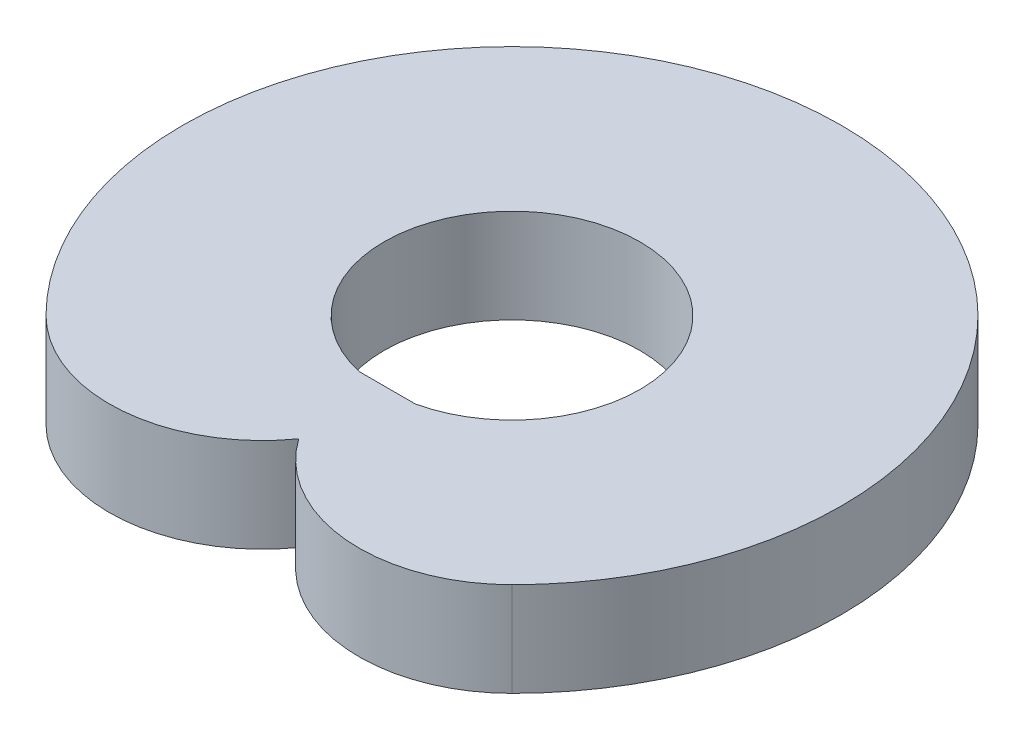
ISO-10303-21;
HEADER;
FILE_DESCRIPTION(('STEP AP214'),'2;1');
FILE_NAME('part.step','',(''),(''),'','','');
FILE_SCHEMA(('AUTOMOTIVE_DESIGN { 1 0 10303 214 1 1 1 1 }'));
ENDSEC;
DATA;
#1=APPLICATION_CONTEXT('core data for automotive mechanical design processes');
#2=APPLICATION_PROTOCOL_DEFINITION('international standard','automotive_design',2000,#1);
#3=PRODUCT_CONTEXT('',#1,'mechanical');
#4=PRODUCT('Part','Part','',(#3));
#5=PRODUCT_RELATED_PRODUCT_CATEGORY('part','',(#4));
#6=PRODUCT_DEFINITION_FORMATION('','',#4);
#7=PRODUCT_DEFINITION_CONTEXT('part definition',#1,'design');
#8=PRODUCT_DEFINITION('design','',#6,#7);
#9=PRODUCT_DEFINITION_SHAPE('','',#8);
#10=(LENGTH_UNIT() NAMED_UNIT(*) SI_UNIT(.MILLI.,.METRE.));
#11=(NAMED_UNIT(*) PLANE_ANGLE_UNIT() SI_UNIT($,.RADIAN.));
#12=(NAMED_UNIT(*) SI_UNIT($,.STERADIAN.) SOLID_ANGLE_UNIT());
#13=UNCERTAINTY_MEASURE_WITH_UNIT(LENGTH_MEASURE(1.E-05),#10,'distance_accuracy_value','');
#14=(GEOMETRIC_REPRESENTATION_CONTEXT(3) GLOBAL_UNCERTAINTY_ASSIGNED_CONTEXT((#13)) GLOBAL_UNIT_ASSIGNED_CONTEXT((#10,
#11,#12)) REPRESENTATION_CONTEXT('',''));
#15=CARTESIAN_POINT('',(0.,0.,0.));
#16=DIRECTION('',(0.,0.,1.));
#17=DIRECTION('',(1.,0.,0.));
#18=AXIS2_PLACEMENT_3D('',#15,#16,#17);
#19=CARTESIAN_POINT('',(132.582521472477,200.,132.582521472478));
#20=DIRECTION('',(0.,1.,0.));
#21=DIRECTION('',(0.,0.,1.));
#22=AXIS2_PLACEMENT_3D('',#19,#20,#21);
#23=PLANE('',#22);
#24=CARTESIAN_POINT('',(265.165042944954,200.,265.165042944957));
#25=DIRECTION('',(0.,1.,0.));
#26=DIRECTION('',(0.,0.,1.));
#27=AXIS2_PLACEMENT_3D('',#24,#25,#26);
#28=CIRCLE('',#27,325.);
#29=CARTESIAN_POINT('',(1.11022302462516E-13,200.,453.08124767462));
#30=VERTEX_POINT('',#29);
#31=CARTESIAN_POINT('',(494.974746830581,200.,494.974746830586));
#32=VERTEX_POINT('',#31);
#33=EDGE_CURVE('E98',#30,#32,#28,.T.);
#34=ORIENTED_EDGE('',*,*,#33,.T.);
#35=CARTESIAN_POINT('',(0.,200.,0.));
#36=DIRECTION('',(0.,1.,0.));
#37=DIRECTION('',(0.,0.,1.));
#38=AXIS2_PLACEMENT_3D('',#35,#36,#37);
#39=CIRCLE('',#38,700.);
#40=CARTESIAN_POINT('',(-494.97474683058,200.,494.974746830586));
#41=VERTEX_POINT('',#40);
#42=EDGE_CURVE('E101',#32,#41,#39,.T.);
#43=ORIENTED_EDGE('',*,*,#42,.T.);
#44=CARTESIAN_POINT('',(-265.165042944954,200.,265.165042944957));
#45=DIRECTION('',(0.,1.,0.));
#46=DIRECTION('',(0.,0.,1.));
#47=AXIS2_PLACEMENT_3D('',#44,#45,#46);
#48=CIRCLE('',#47,325.);
#49=EDGE_CURVE('E104',#41,#30,#48,.T.);
#50=ORIENTED_EDGE('',*,*,#49,.T.);
#51=EDGE_LOOP('',(#34,#43,#50));
#52=FACE_BOUND('',#51,.T.);
#53=DIRECTION('',(1.,0.,0.));
#54=VECTOR('',#53,1.);
#55=CARTESIAN_POINT('',(59.8349570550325,200.,265.165042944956));
#56=LINE('',#55,#54);
#57=CARTESIAN_POINT('',(-59.8349570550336,200.,265.165042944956));
#58=VERTEX_POINT('',#57);
#59=CARTESIAN_POINT('',(59.8349570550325,200.,265.165042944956));
#60=VERTEX_POINT('',#59);
#61=EDGE_CURVE('E81',#58,#60,#56,.T.);
#62=ORIENTED_EDGE('',*,*,#61,.F.);
#63=CARTESIAN_POINT('',(0.,200.,0.));
#64=DIRECTION('',(0.,1.,0.));
#65=DIRECTION('',(0.,0.,1.));
#66=AXIS2_PLACEMENT_3D('',#63,#64,#65);
#67=CIRCLE('',#66,271.832157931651);
#68=EDGE_CURVE('E87',#60,#58,#67,.T.);
#69=ORIENTED_EDGE('',*,*,#68,.F.);
#70=EDGE_LOOP('',(#62,#69));
#71=FACE_BOUND('',#70,.T.);
#72=ADVANCED_FACE('F35',(#52,#71),#23,.T.);
#73=CARTESIAN_POINT('',(132.582521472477,0.,132.582521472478));
#74=DIRECTION('',(0.,1.,0.));
#75=DIRECTION('',(0.,0.,1.));
#76=AXIS2_PLACEMENT_3D('',#73,#74,#75);
#77=PLANE('',#76);
#78=CARTESIAN_POINT('',(265.165042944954,0.,265.165042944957));
#79=DIRECTION('',(0.,1.,0.));
#80=DIRECTION('',(0.,0.,1.));
#81=AXIS2_PLACEMENT_3D('',#78,#79,#80);
#82=CIRCLE('',#81,325.);
#83=CARTESIAN_POINT('',(1.11022302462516E-13,0.,453.08124767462));
#84=VERTEX_POINT('',#83);
#85=CARTESIAN_POINT('',(494.974746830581,0.,494.974746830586));
#86=VERTEX_POINT('',#85);
#87=EDGE_CURVE('E97',#84,#86,#82,.T.);
#88=ORIENTED_EDGE('',*,*,#87,.F.);
#89=CARTESIAN_POINT('',(-265.165042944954,0.,265.165042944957));
#90=DIRECTION('',(0.,1.,0.));
#91=DIRECTION('',(0.,0.,1.));
#92=AXIS2_PLACEMENT_3D('',#89,#90,#91);
#93=CIRCLE('',#92,325.);
#94=CARTESIAN_POINT('',(-494.97474683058,0.,494.974746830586));
#95=VERTEX_POINT('',#94);
#96=EDGE_CURVE('E102',#95,#84,#93,.T.);
#97=ORIENTED_EDGE('',*,*,#96,.F.);
#98=CARTESIAN_POINT('',(0.,0.,0.));
#99=DIRECTION('',(0.,1.,0.));
#100=DIRECTION('',(0.,0.,1.));
#101=AXIS2_PLACEMENT_3D('',#98,#99,#100);
#102=CIRCLE('',#101,700.);
#103=EDGE_CURVE('E109',#86,#95,#102,.T.);
#104=ORIENTED_EDGE('',*,*,#103,.F.);
#105=EDGE_LOOP('',(#88,#97,#104));
#106=FACE_BOUND('',#105,.T.);
#107=CARTESIAN_POINT('',(0.,0.,0.));
#108=DIRECTION('',(0.,1.,0.));
#109=DIRECTION('',(0.,0.,1.));
#110=AXIS2_PLACEMENT_3D('',#107,#108,#109);
#111=CIRCLE('',#110,271.832157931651);
#112=CARTESIAN_POINT('',(59.8349570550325,0.,265.165042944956));
#113=VERTEX_POINT('',#112);
#114=CARTESIAN_POINT('',(-59.8349570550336,0.,265.165042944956));
#115=VERTEX_POINT('',#114);
#116=EDGE_CURVE('E57',#113,#115,#111,.T.);
#117=ORIENTED_EDGE('',*,*,#116,.T.);
#118=DIRECTION('',(1.,0.,0.));
#119=VECTOR('',#118,1.);
#120=CARTESIAN_POINT('',(59.8349570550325,0.,265.165042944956));
#121=LINE('',#120,#119);
#122=EDGE_CURVE('E91',#115,#113,#121,.T.);
#123=ORIENTED_EDGE('',*,*,#122,.T.);
#124=EDGE_LOOP('',(#117,#123));
#125=FACE_BOUND('',#124,.T.);
#126=ADVANCED_FACE('F123',(#106,#125),#77,.F.);
#127=CARTESIAN_POINT('',(265.165042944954,200.,265.165042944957));
#128=DIRECTION('',(0.,-1.,0.));
#129=DIRECTION('',(0.,0.,-1.));
#130=AXIS2_PLACEMENT_3D('',#127,#128,#129);
#131=CYLINDRICAL_SURFACE('',#130,325.);
#132=ORIENTED_EDGE('',*,*,#87,.T.);
#133=DIRECTION('',(0.,-1.,0.));
#134=VECTOR('',#133,1.);
#135=CARTESIAN_POINT('',(494.974746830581,200.,494.974746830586));
#136=LINE('',#135,#134);
#137=EDGE_CURVE('E11',#32,#86,#136,.T.);
#138=ORIENTED_EDGE('',*,*,#137,.F.);
#139=ORIENTED_EDGE('',*,*,#33,.F.);
#140=DIRECTION('',(0.,-1.,0.));
#141=VECTOR('',#140,1.);
#142=CARTESIAN_POINT('',(1.11022302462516E-13,200.,453.08124767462));
#143=LINE('',#142,#141);
#144=EDGE_CURVE('E106',#30,#84,#143,.T.);
#145=ORIENTED_EDGE('',*,*,#144,.T.);
#146=EDGE_LOOP('',(#132,#138,#139,#145));
#147=FACE_BOUND('',#146,.T.);
#148=ADVANCED_FACE('F37',(#147),#131,.T.);
#149=CARTESIAN_POINT('',(0.,200.,0.));
#150=DIRECTION('',(0.,-1.,0.));
#151=DIRECTION('',(0.,0.,-1.));
#152=AXIS2_PLACEMENT_3D('',#149,#150,#151);
#153=CYLINDRICAL_SURFACE('',#152,700.);
#154=ORIENTED_EDGE('',*,*,#103,.T.);
#155=DIRECTION('',(0.,-1.,0.));
#156=VECTOR('',#155,1.);
#157=CARTESIAN_POINT('',(-494.97474683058,200.,494.974746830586));
#158=LINE('',#157,#156);
#159=EDGE_CURVE('E43',#41,#95,#158,.T.);
#160=ORIENTED_EDGE('',*,*,#159,.F.);
#161=ORIENTED_EDGE('',*,*,#42,.F.);
#162=ORIENTED_EDGE('',*,*,#137,.T.);
#163=EDGE_LOOP('',(#154,#160,#161,#162));
#164=FACE_BOUND('',#163,.T.);
#165=ADVANCED_FACE('F129',(#164),#153,.T.);
#166=CARTESIAN_POINT('',(-265.165042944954,200.,265.165042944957));
#167=DIRECTION('',(0.,-1.,0.));
#168=DIRECTION('',(0.,0.,-1.));
#169=AXIS2_PLACEMENT_3D('',#166,#167,#168);
#170=CYLINDRICAL_SURFACE('',#169,325.);
#171=ORIENTED_EDGE('',*,*,#96,.T.);
#172=ORIENTED_EDGE('',*,*,#144,.F.);
#173=ORIENTED_EDGE('',*,*,#49,.F.);
#174=ORIENTED_EDGE('',*,*,#159,.T.);
#175=EDGE_LOOP('',(#171,#172,#173,#174));
#176=FACE_BOUND('',#175,.T.);
#177=ADVANCED_FACE('F118',(#176),#170,.T.);
#178=CARTESIAN_POINT('',(0.,200.,0.));
#179=DIRECTION('',(0.,-1.,0.));
#180=DIRECTION('',(0.,0.,-1.));
#181=AXIS2_PLACEMENT_3D('',#178,#179,#180);
#182=CYLINDRICAL_SURFACE('',#181,271.832157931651);
#183=ORIENTED_EDGE('',*,*,#116,.F.);
#184=DIRECTION('',(0.,-1.,0.));
#185=VECTOR('',#184,1.);
#186=CARTESIAN_POINT('',(59.8349570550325,200.,265.165042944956));
#187=LINE('',#186,#185);
#188=EDGE_CURVE('E83',#60,#113,#187,.T.);
#189=ORIENTED_EDGE('',*,*,#188,.F.);
#190=ORIENTED_EDGE('',*,*,#68,.T.);
#191=DIRECTION('',(0.,-1.,0.));
#192=VECTOR('',#191,1.);
#193=CARTESIAN_POINT('',(-59.8349570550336,200.,265.165042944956));
#194=LINE('',#193,#192);
#195=EDGE_CURVE('E50',#58,#115,#194,.T.);
#196=ORIENTED_EDGE('',*,*,#195,.T.);
#197=EDGE_LOOP('',(#183,#189,#190,#196));
#198=FACE_BOUND('',#197,.T.);
#199=ADVANCED_FACE('F89',(#198),#182,.F.);
#200=CARTESIAN_POINT('',(59.8349570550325,200.,265.165042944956));
#201=DIRECTION('',(0.,0.,-1.));
#202=DIRECTION('',(-1.,0.,0.));
#203=AXIS2_PLACEMENT_3D('',#200,#201,#202);
#204=PLANE('',#203);
#205=ORIENTED_EDGE('',*,*,#122,.F.);
#206=ORIENTED_EDGE('',*,*,#195,.F.);
#207=ORIENTED_EDGE('',*,*,#61,.T.);
#208=ORIENTED_EDGE('',*,*,#188,.T.);
#209=EDGE_LOOP('',(#205,#206,#207,#208));
#210=FACE_BOUND('',#209,.T.);
#211=ADVANCED_FACE('F82',(#210),#204,.T.);
#212=CLOSED_SHELL('',(#72,#126,#148,#165,#177,#199,#211));
#213=MANIFOLD_SOLID_BREP('B2',#212);
#214=ADVANCED_BREP_SHAPE_REPRESENTATION('',(#18,#213),#14);
#215=SHAPE_DEFINITION_REPRESENTATION(#9,#214);
ENDSEC;
END-ISO-10303-21;
